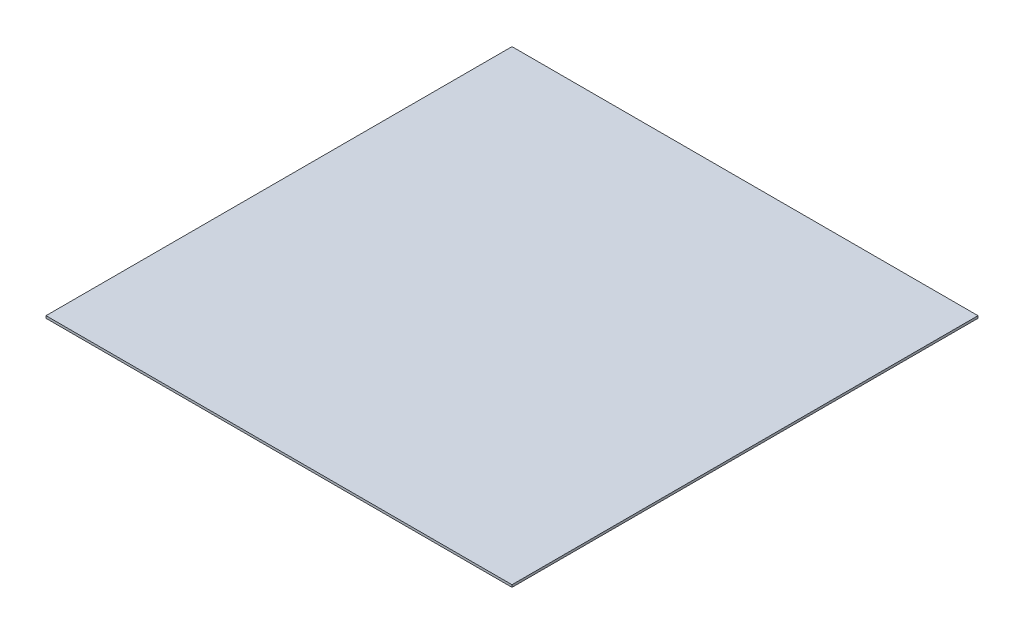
from build123d import *

# Parameters (mm, degrees)
ESBO_O1_W                = 1000
ESBO_O1_H                = 1000
RESSALTO_EXTRUS_O1_DEPTH = 5


with BuildPart() as part:
    # Esbo_o1 → Ressalto-extrus_o1 (new body)
    with BuildSketch(Plane(origin=(0, 0, 0), x_dir=(1, 0, 0), z_dir=(0, 1, 0))):
        with Locations((500, 500)):
            Rectangle(ESBO_O1_W, ESBO_O1_H)
    extrude(amount=RESSALTO_EXTRUS_O1_DEPTH)


solid = part.part
